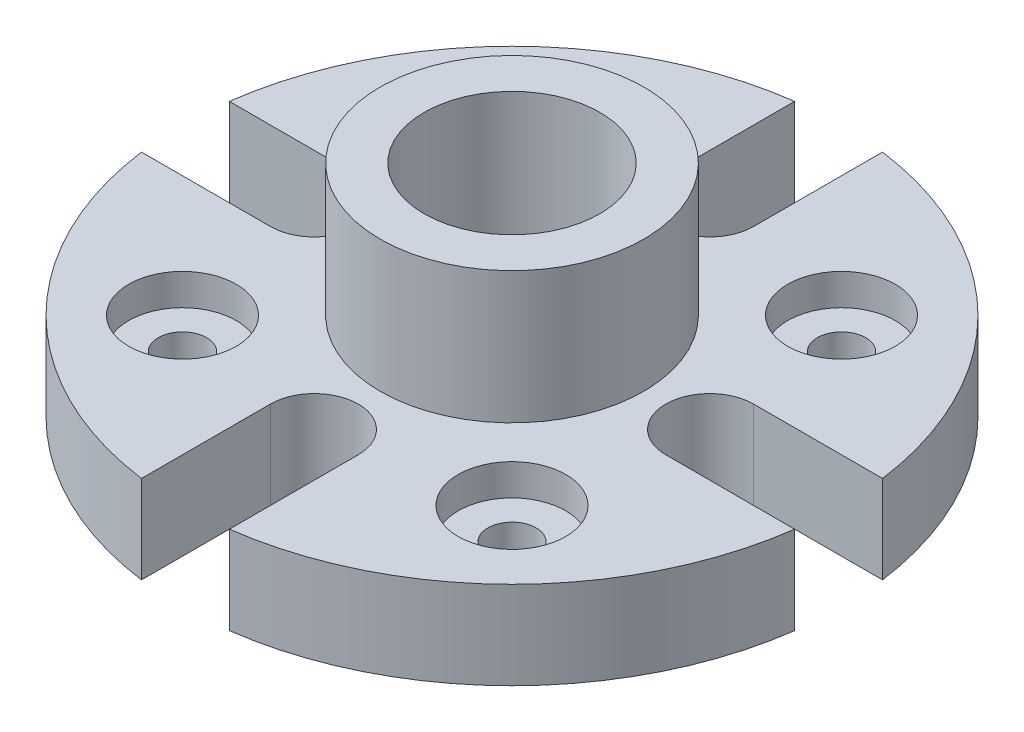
from build123d import *

# Parameters (mm, degrees)
SKETCH1_R                               = 37.5
EXTRUDE1_DEPTH                          = 10
SKETCH3_R                               = 15
SKETCH3_R_2                             = 10
EXTRUDE3_DEPTH                          = 15
CUT_EXTRUDE1_START                      = -10
CUT_EXTRUDE1_DEPTH                      = 10
CBORE_FOR_M5_HEX_HEAD_BOLT1_D           = 5.5
CBORE_FOR_M5_HEX_HEAD_BOLT1_CBORE_D     = 12.24
CBORE_FOR_M5_HEX_HEAD_BOLT1_CBORE_DEPTH = 3.58
CIRPATTERN1_COUNT                       = 4
CUT_EXTRUDE2_START                      = -10
SKETCH7_R                               = 10
CUT_EXTRUDE2_DEPTH                      = 10


with BuildPart() as part:
    # Sketch1 → Extrude1 (new body)
    with BuildSketch(Plane(origin=(0, 0, 0), x_dir=(1, 0, 0), z_dir=(0, 1, 0))):
        with Locations(Location((0, 0, 0), (0, 0, 270))):
            Circle(SKETCH1_R)
    extrude(amount=EXTRUDE1_DEPTH)

    # Sketch3 → Extrude3 (add)
    with BuildSketch(Plane(origin=(0, 10, 0), x_dir=(-1, 0, 0), z_dir=(0, 1, 0))):
        with Locations(Location((0, 0, 0), (0, 0, 90))):
            Circle(SKETCH3_R)
        with Locations(Location((0, 0, 0), (0, 0, 90))):
            Circle(SKETCH3_R_2, mode=Mode.SUBTRACT)
    extrude(amount=EXTRUDE3_DEPTH)

    # Sketch2 → Cut-Extrude1 (cut)
    with BuildSketch(Plane(origin=(0, 10, 0), x_dir=(-1, 0, 0), z_dir=(0, 1, 0)).offset(CUT_EXTRUDE1_START)):
        with BuildLine():
            Line((5, -37.165171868), (5, -22.5))
            ThreePointArc((5, -22.5), (0, -17.5), (-5, -22.5))
            Line((-5, -22.5), (-5, -37.165171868))
            ThreePointArc((-5, -37.165171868), (0, -37.5), (5, -37.165171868))
        make_face()
    cut_extrude1 = extrude(amount=CUT_EXTRUDE1_DEPTH, mode=Mode.SUBTRACT)

    # CBORE for M5 Hex Head Bolt1 (through all)
    with Locations(Plane(origin=(0, 10, 0), x_dir=(-1, 0, 0), z_dir=(0, 1, 0))):
        with Locations((18.75, -18.75)):
            cbore_for_m5_hex_head_bolt1 = CounterBoreHole(CBORE_FOR_M5_HEX_HEAD_BOLT1_D / 2, CBORE_FOR_M5_HEX_HEAD_BOLT1_CBORE_D / 2, CBORE_FOR_M5_HEX_HEAD_BOLT1_CBORE_DEPTH)

    # CirPattern1: Cut-Extrude1, CBORE for M5 Hex Head Bolt1 ×4 about axis
    cirpattern1_axis = Axis((0, 0, 0), (0, 1, 0))
    add([cut_extrude1.rotate(cirpattern1_axis, i * 360 / CIRPATTERN1_COUNT) for i in range(1, CIRPATTERN1_COUNT)], mode=Mode.SUBTRACT)
    add([cbore_for_m5_hex_head_bolt1.rotate(cirpattern1_axis, i * 360 / CIRPATTERN1_COUNT) for i in range(1, CIRPATTERN1_COUNT)], mode=Mode.SUBTRACT)

    # Sketch7 → Cut-Extrude2 (cut)
    with BuildSketch(Plane(origin=(0, 10, 0), x_dir=(-1, 0, 0), z_dir=(0, 1, 0)).offset(CUT_EXTRUDE2_START)):
        with Locations(Location((0, 0, 0), (0, 0, 90))):
            Circle(SKETCH7_R)
    extrude(amount=CUT_EXTRUDE2_DEPTH, mode=Mode.SUBTRACT)


solid = part.part
